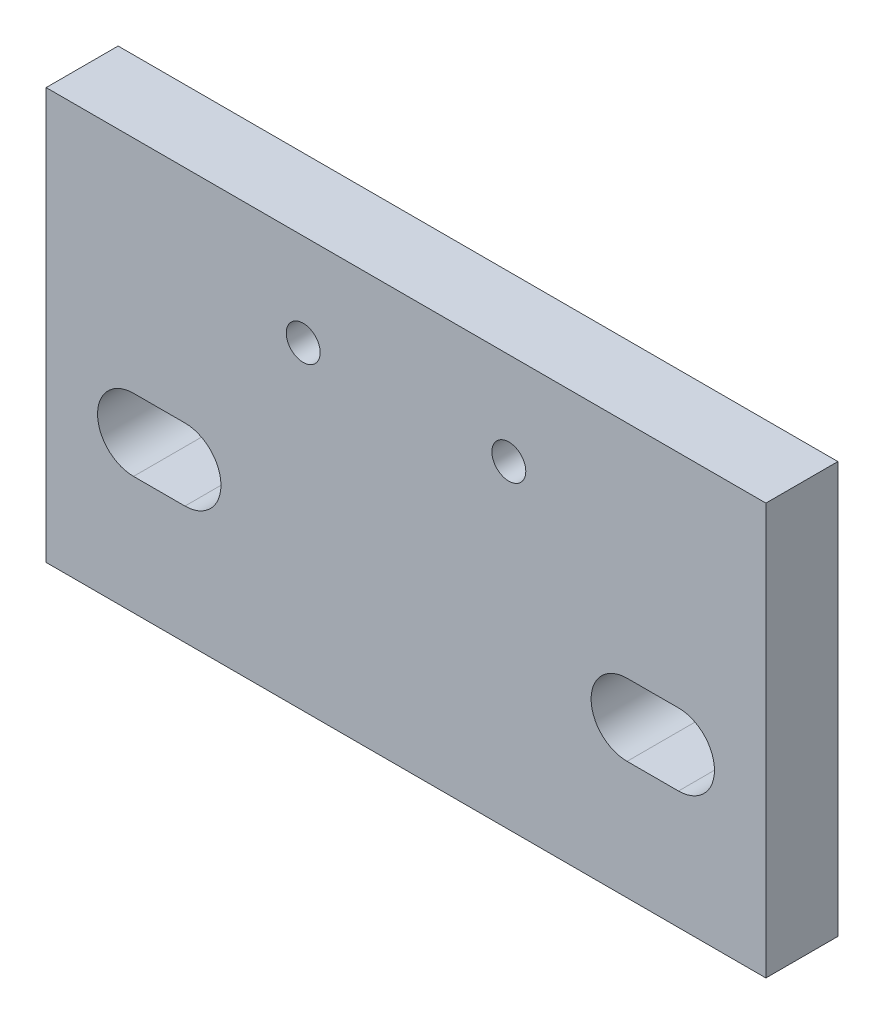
ISO-10303-21;
HEADER;
FILE_DESCRIPTION(('STEP AP214'),'2;1');
FILE_NAME('part.step','',(''),(''),'','','');
FILE_SCHEMA(('AUTOMOTIVE_DESIGN { 1 0 10303 214 1 1 1 1 }'));
ENDSEC;
DATA;
#1=APPLICATION_CONTEXT('core data for automotive mechanical design processes');
#2=APPLICATION_PROTOCOL_DEFINITION('international standard','automotive_design',2000,#1);
#3=PRODUCT_CONTEXT('',#1,'mechanical');
#4=PRODUCT('Part','Part','',(#3));
#5=PRODUCT_RELATED_PRODUCT_CATEGORY('part','',(#4));
#6=PRODUCT_DEFINITION_FORMATION('','',#4);
#7=PRODUCT_DEFINITION_CONTEXT('part definition',#1,'design');
#8=PRODUCT_DEFINITION('design','',#6,#7);
#9=PRODUCT_DEFINITION_SHAPE('','',#8);
#10=(LENGTH_UNIT() NAMED_UNIT(*) SI_UNIT(.MILLI.,.METRE.));
#11=(NAMED_UNIT(*) PLANE_ANGLE_UNIT() SI_UNIT($,.RADIAN.));
#12=(NAMED_UNIT(*) SI_UNIT($,.STERADIAN.) SOLID_ANGLE_UNIT());
#13=UNCERTAINTY_MEASURE_WITH_UNIT(LENGTH_MEASURE(1.E-05),#10,'distance_accuracy_value','');
#14=(GEOMETRIC_REPRESENTATION_CONTEXT(3) GLOBAL_UNCERTAINTY_ASSIGNED_CONTEXT((#13)) GLOBAL_UNIT_ASSIGNED_CONTEXT((#10,
#11,#12)) REPRESENTATION_CONTEXT('',''));
#15=CARTESIAN_POINT('',(0.,0.,0.));
#16=DIRECTION('',(0.,0.,1.));
#17=DIRECTION('',(1.,0.,0.));
#18=AXIS2_PLACEMENT_3D('',#15,#16,#17);
#19=CARTESIAN_POINT('',(-35.,0.,7.00000000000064));
#20=DIRECTION('',(1.,0.,0.));
#21=DIRECTION('',(0.,0.,-1.));
#22=AXIS2_PLACEMENT_3D('',#19,#20,#21);
#23=PLANE('',#22);
#24=DIRECTION('',(0.,-1.,0.));
#25=VECTOR('',#24,1.);
#26=CARTESIAN_POINT('',(-35.,0.,6.38378239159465E-13));
#27=LINE('',#26,#25);
#28=CARTESIAN_POINT('',(-35.,0.,6.38378239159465E-13));
#29=VERTEX_POINT('',#28);
#30=CARTESIAN_POINT('',(-35.,-40.,0.));
#31=VERTEX_POINT('',#30);
#32=EDGE_CURVE('E169',#29,#31,#27,.T.);
#33=ORIENTED_EDGE('',*,*,#32,.T.);
#34=DIRECTION('',(0.,0.,-1.));
#35=VECTOR('',#34,1.);
#36=CARTESIAN_POINT('',(-35.,-40.,7.00000000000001));
#37=LINE('',#36,#35);
#38=CARTESIAN_POINT('',(-35.,-40.,7.00000000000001));
#39=VERTEX_POINT('',#38);
#40=EDGE_CURVE('E11',#39,#31,#37,.T.);
#41=ORIENTED_EDGE('',*,*,#40,.F.);
#42=DIRECTION('',(0.,-1.,0.));
#43=VECTOR('',#42,1.);
#44=CARTESIAN_POINT('',(-35.,0.,7.00000000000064));
#45=LINE('',#44,#43);
#46=CARTESIAN_POINT('',(-35.,0.,7.00000000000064));
#47=VERTEX_POINT('',#46);
#48=EDGE_CURVE('E176',#47,#39,#45,.T.);
#49=ORIENTED_EDGE('',*,*,#48,.F.);
#50=DIRECTION('',(0.,0.,-1.));
#51=VECTOR('',#50,1.);
#52=CARTESIAN_POINT('',(-35.,0.,7.00000000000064));
#53=LINE('',#52,#51);
#54=EDGE_CURVE('E186',#47,#29,#53,.T.);
#55=ORIENTED_EDGE('',*,*,#54,.T.);
#56=EDGE_LOOP('',(#33,#41,#49,#55));
#57=FACE_BOUND('',#56,.T.);
#58=ADVANCED_FACE('F16',(#57),#23,.F.);
#59=CARTESIAN_POINT('',(-35.,-40.,7.00000000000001));
#60=DIRECTION('',(0.,1.,0.));
#61=DIRECTION('',(0.,0.,1.));
#62=AXIS2_PLACEMENT_3D('',#59,#60,#61);
#63=PLANE('',#62);
#64=DIRECTION('',(1.,0.,0.));
#65=VECTOR('',#64,1.);
#66=CARTESIAN_POINT('',(-35.,-40.,0.));
#67=LINE('',#66,#65);
#68=CARTESIAN_POINT('',(35.0000000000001,-40.0000000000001,0.));
#69=VERTEX_POINT('',#68);
#70=EDGE_CURVE('E189',#31,#69,#67,.T.);
#71=ORIENTED_EDGE('',*,*,#70,.T.);
#72=DIRECTION('',(0.,0.,-1.));
#73=VECTOR('',#72,1.);
#74=CARTESIAN_POINT('',(35.0000000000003,-40.0000000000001,7.00000000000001));
#75=LINE('',#74,#73);
#76=CARTESIAN_POINT('',(35.0000000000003,-40.0000000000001,7.00000000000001));
#77=VERTEX_POINT('',#76);
#78=EDGE_CURVE('E23',#77,#69,#75,.T.);
#79=ORIENTED_EDGE('',*,*,#78,.F.);
#80=DIRECTION('',(1.,0.,0.));
#81=VECTOR('',#80,1.);
#82=CARTESIAN_POINT('',(-35.,-40.,7.00000000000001));
#83=LINE('',#82,#81);
#84=EDGE_CURVE('E179',#39,#77,#83,.T.);
#85=ORIENTED_EDGE('',*,*,#84,.F.);
#86=ORIENTED_EDGE('',*,*,#40,.T.);
#87=EDGE_LOOP('',(#71,#79,#85,#86));
#88=FACE_BOUND('',#87,.T.);
#89=ADVANCED_FACE('F218',(#88),#63,.F.);
#90=CARTESIAN_POINT('',(35.0000000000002,1.11022302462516E-13,7.00000000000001));
#91=DIRECTION('',(-1.,0.,0.));
#92=DIRECTION('',(0.,0.,1.));
#93=AXIS2_PLACEMENT_3D('',#90,#91,#92);
#94=PLANE('',#93);
#95=DIRECTION('',(0.,1.,0.));
#96=VECTOR('',#95,1.);
#97=CARTESIAN_POINT('',(35.,0.,0.));
#98=LINE('',#97,#96);
#99=CARTESIAN_POINT('',(35.,0.,0.));
#100=VERTEX_POINT('',#99);
#101=EDGE_CURVE('E191',#69,#100,#98,.T.);
#102=ORIENTED_EDGE('',*,*,#101,.T.);
#103=DIRECTION('',(0.,0.,-1.));
#104=VECTOR('',#103,1.);
#105=CARTESIAN_POINT('',(35.0000000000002,1.11022302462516E-13,7.00000000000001));
#106=LINE('',#105,#104);
#107=CARTESIAN_POINT('',(35.0000000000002,1.11022302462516E-13,7.00000000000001));
#108=VERTEX_POINT('',#107);
#109=EDGE_CURVE('E196',#108,#100,#106,.T.);
#110=ORIENTED_EDGE('',*,*,#109,.F.);
#111=DIRECTION('',(0.,1.,0.));
#112=VECTOR('',#111,1.);
#113=CARTESIAN_POINT('',(35.0000000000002,1.11022302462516E-13,7.00000000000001));
#114=LINE('',#113,#112);
#115=EDGE_CURVE('E182',#77,#108,#114,.T.);
#116=ORIENTED_EDGE('',*,*,#115,.F.);
#117=ORIENTED_EDGE('',*,*,#78,.T.);
#118=EDGE_LOOP('',(#102,#110,#116,#117));
#119=FACE_BOUND('',#118,.T.);
#120=ADVANCED_FACE('F203',(#119),#94,.F.);
#121=CARTESIAN_POINT('',(-35.,0.,7.00000000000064));
#122=DIRECTION('',(0.,-1.,0.));
#123=DIRECTION('',(0.,0.,-1.));
#124=AXIS2_PLACEMENT_3D('',#121,#122,#123);
#125=PLANE('',#124);
#126=DIRECTION('',(-1.,0.,0.));
#127=VECTOR('',#126,1.);
#128=CARTESIAN_POINT('',(-35.,0.,6.38378239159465E-13));
#129=LINE('',#128,#127);
#130=EDGE_CURVE('E180',#100,#29,#129,.T.);
#131=ORIENTED_EDGE('',*,*,#130,.T.);
#132=ORIENTED_EDGE('',*,*,#54,.F.);
#133=DIRECTION('',(-1.,0.,0.));
#134=VECTOR('',#133,1.);
#135=CARTESIAN_POINT('',(-35.,0.,7.00000000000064));
#136=LINE('',#135,#134);
#137=EDGE_CURVE('E184',#108,#47,#136,.T.);
#138=ORIENTED_EDGE('',*,*,#137,.F.);
#139=ORIENTED_EDGE('',*,*,#109,.T.);
#140=EDGE_LOOP('',(#131,#132,#138,#139));
#141=FACE_BOUND('',#140,.T.);
#142=ADVANCED_FACE('F212',(#141),#125,.F.);
#143=CARTESIAN_POINT('',(-35.,-40.,7.00000000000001));
#144=DIRECTION('',(0.,0.,1.));
#145=DIRECTION('',(1.,0.,0.));
#146=AXIS2_PLACEMENT_3D('',#143,#144,#145);
#147=PLANE('',#146);
#148=CARTESIAN_POINT('',(10.,-9.00000000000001,7.00000000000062));
#149=DIRECTION('',(0.,0.,1.));
#150=DIRECTION('',(1.,0.,0.));
#151=AXIS2_PLACEMENT_3D('',#148,#149,#150);
#152=CIRCLE('',#151,1.65);
#153=CARTESIAN_POINT('',(11.65,-9.00000000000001,7.00000000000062));
#154=VERTEX_POINT('',#153);
#155=EDGE_CURVE('E277',#154,#154,#152,.T.);
#156=ORIENTED_EDGE('',*,*,#155,.F.);
#157=EDGE_LOOP('',(#156));
#158=FACE_BOUND('',#157,.T.);
#159=CARTESIAN_POINT('',(-9.99999999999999,-8.99999999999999,7.00000000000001));
#160=DIRECTION('',(0.,0.,1.));
#161=DIRECTION('',(1.,0.,0.));
#162=AXIS2_PLACEMENT_3D('',#159,#160,#161);
#163=CIRCLE('',#162,1.65);
#164=CARTESIAN_POINT('',(-8.34999999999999,-8.99999999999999,7.00000000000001));
#165=VERTEX_POINT('',#164);
#166=EDGE_CURVE('E128',#165,#165,#163,.T.);
#167=ORIENTED_EDGE('',*,*,#166,.F.);
#168=EDGE_LOOP('',(#167));
#169=FACE_BOUND('',#168,.T.);
#170=CARTESIAN_POINT('',(-21.5,-25.,7.00000000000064));
#171=DIRECTION('',(0.,0.,-1.));
#172=DIRECTION('',(-1.,0.,0.));
#173=AXIS2_PLACEMENT_3D('',#170,#171,#172);
#174=CIRCLE('',#173,3.5);
#175=CARTESIAN_POINT('',(-21.5,-21.5,7.00000000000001));
#176=VERTEX_POINT('',#175);
#177=CARTESIAN_POINT('',(-21.5,-28.5,7.00000000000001));
#178=VERTEX_POINT('',#177);
#179=EDGE_CURVE('E106',#176,#178,#174,.T.);
#180=ORIENTED_EDGE('',*,*,#179,.T.);
#181=DIRECTION('',(-1.,0.,0.));
#182=VECTOR('',#181,1.);
#183=CARTESIAN_POINT('',(-21.5,-28.5,7.00000000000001));
#184=LINE('',#183,#182);
#185=CARTESIAN_POINT('',(-26.5,-28.5,7.00000000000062));
#186=VERTEX_POINT('',#185);
#187=EDGE_CURVE('E115',#178,#186,#184,.T.);
#188=ORIENTED_EDGE('',*,*,#187,.T.);
#189=CARTESIAN_POINT('',(-26.5,-25.,7.00000000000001));
#190=DIRECTION('',(0.,0.,-1.));
#191=DIRECTION('',(1.,0.,0.));
#192=AXIS2_PLACEMENT_3D('',#189,#190,#191);
#193=CIRCLE('',#192,3.5);
#194=CARTESIAN_POINT('',(-26.5,-21.5,7.00000000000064));
#195=VERTEX_POINT('',#194);
#196=EDGE_CURVE('E30',#186,#195,#193,.T.);
#197=ORIENTED_EDGE('',*,*,#196,.T.);
#198=DIRECTION('',(1.,0.,0.));
#199=VECTOR('',#198,1.);
#200=CARTESIAN_POINT('',(-21.5,-21.5,7.00000000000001));
#201=LINE('',#200,#199);
#202=EDGE_CURVE('E112',#195,#176,#201,.T.);
#203=ORIENTED_EDGE('',*,*,#202,.T.);
#204=EDGE_LOOP('',(#180,#188,#197,#203));
#205=FACE_BOUND('',#204,.T.);
#206=CARTESIAN_POINT('',(26.5000000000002,-24.9999999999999,7.00000000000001));
#207=DIRECTION('',(0.,0.,-1.));
#208=DIRECTION('',(-1.,0.,0.));
#209=AXIS2_PLACEMENT_3D('',#206,#207,#208);
#210=CIRCLE('',#209,3.5);
#211=CARTESIAN_POINT('',(26.5,-21.5,7.00000000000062));
#212=VERTEX_POINT('',#211);
#213=CARTESIAN_POINT('',(26.5000000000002,-28.4999999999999,7.00000000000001));
#214=VERTEX_POINT('',#213);
#215=EDGE_CURVE('E144',#212,#214,#210,.T.);
#216=ORIENTED_EDGE('',*,*,#215,.T.);
#217=DIRECTION('',(-1.,0.,0.));
#218=VECTOR('',#217,1.);
#219=CARTESIAN_POINT('',(26.5000000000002,-28.4999999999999,7.00000000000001));
#220=LINE('',#219,#218);
#221=CARTESIAN_POINT('',(21.5000000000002,-28.4999999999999,7.00000000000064));
#222=VERTEX_POINT('',#221);
#223=EDGE_CURVE('E147',#214,#222,#220,.T.);
#224=ORIENTED_EDGE('',*,*,#223,.T.);
#225=CARTESIAN_POINT('',(21.5,-25.,7.00000000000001));
#226=DIRECTION('',(0.,0.,-1.));
#227=DIRECTION('',(1.,0.,0.));
#228=AXIS2_PLACEMENT_3D('',#225,#226,#227);
#229=CIRCLE('',#228,3.5);
#230=CARTESIAN_POINT('',(21.5,-21.5,7.00000000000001));
#231=VERTEX_POINT('',#230);
#232=EDGE_CURVE('E151',#222,#231,#229,.T.);
#233=ORIENTED_EDGE('',*,*,#232,.T.);
#234=DIRECTION('',(1.,0.,0.));
#235=VECTOR('',#234,1.);
#236=CARTESIAN_POINT('',(26.5,-21.5,7.00000000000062));
#237=LINE('',#236,#235);
#238=EDGE_CURVE('E154',#231,#212,#237,.T.);
#239=ORIENTED_EDGE('',*,*,#238,.T.);
#240=EDGE_LOOP('',(#216,#224,#233,#239));
#241=FACE_BOUND('',#240,.T.);
#242=ORIENTED_EDGE('',*,*,#48,.T.);
#243=ORIENTED_EDGE('',*,*,#84,.T.);
#244=ORIENTED_EDGE('',*,*,#115,.T.);
#245=ORIENTED_EDGE('',*,*,#137,.T.);
#246=EDGE_LOOP('',(#242,#243,#244,#245));
#247=FACE_BOUND('',#246,.T.);
#248=ADVANCED_FACE('F119',(#158,#169,#205,#241,#247),#147,.T.);
#249=CARTESIAN_POINT('',(-35.,-40.,0.));
#250=DIRECTION('',(0.,0.,1.));
#251=DIRECTION('',(1.,0.,0.));
#252=AXIS2_PLACEMENT_3D('',#249,#250,#251);
#253=PLANE('',#252);
#254=CARTESIAN_POINT('',(10.,-9.00000000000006,6.38378239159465E-13));
#255=DIRECTION('',(0.,0.,1.));
#256=DIRECTION('',(1.,0.,0.));
#257=AXIS2_PLACEMENT_3D('',#254,#255,#256);
#258=CIRCLE('',#257,1.65);
#259=CARTESIAN_POINT('',(11.6500000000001,-9.00000000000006,6.38378239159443E-13));
#260=VERTEX_POINT('',#259);
#261=EDGE_CURVE('E274',#260,#260,#258,.T.);
#262=ORIENTED_EDGE('',*,*,#261,.T.);
#263=EDGE_LOOP('',(#262));
#264=FACE_BOUND('',#263,.T.);
#265=CARTESIAN_POINT('',(-10.,-8.99999999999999,0.));
#266=DIRECTION('',(0.,0.,1.));
#267=DIRECTION('',(1.,0.,0.));
#268=AXIS2_PLACEMENT_3D('',#265,#266,#267);
#269=CIRCLE('',#268,1.65);
#270=CARTESIAN_POINT('',(-8.35,-8.99999999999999,0.));
#271=VERTEX_POINT('',#270);
#272=EDGE_CURVE('E278',#271,#271,#269,.T.);
#273=ORIENTED_EDGE('',*,*,#272,.T.);
#274=EDGE_LOOP('',(#273));
#275=FACE_BOUND('',#274,.T.);
#276=DIRECTION('',(-1.,0.,0.));
#277=VECTOR('',#276,1.);
#278=CARTESIAN_POINT('',(-21.5,-28.5,0.));
#279=LINE('',#278,#277);
#280=CARTESIAN_POINT('',(-21.5,-28.5,0.));
#281=VERTEX_POINT('',#280);
#282=CARTESIAN_POINT('',(-26.5,-28.5,6.38378239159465E-13));
#283=VERTEX_POINT('',#282);
#284=EDGE_CURVE('E134',#281,#283,#279,.T.);
#285=ORIENTED_EDGE('',*,*,#284,.F.);
#286=CARTESIAN_POINT('',(-21.5,-25.,6.38378239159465E-13));
#287=DIRECTION('',(0.,0.,-1.));
#288=DIRECTION('',(-1.,0.,0.));
#289=AXIS2_PLACEMENT_3D('',#286,#287,#288);
#290=CIRCLE('',#289,3.5);
#291=CARTESIAN_POINT('',(-21.5,-21.5000000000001,0.));
#292=VERTEX_POINT('',#291);
#293=EDGE_CURVE('E38',#292,#281,#290,.T.);
#294=ORIENTED_EDGE('',*,*,#293,.F.);
#295=DIRECTION('',(1.,0.,0.));
#296=VECTOR('',#295,1.);
#297=CARTESIAN_POINT('',(-21.5,-21.5000000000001,0.));
#298=LINE('',#297,#296);
#299=CARTESIAN_POINT('',(-26.5,-21.5,6.38378239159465E-13));
#300=VERTEX_POINT('',#299);
#301=EDGE_CURVE('E122',#300,#292,#298,.T.);
#302=ORIENTED_EDGE('',*,*,#301,.F.);
#303=CARTESIAN_POINT('',(-26.5,-25.,0.));
#304=DIRECTION('',(0.,0.,-1.));
#305=DIRECTION('',(1.,0.,0.));
#306=AXIS2_PLACEMENT_3D('',#303,#304,#305);
#307=CIRCLE('',#306,3.5);
#308=EDGE_CURVE('E125',#283,#300,#307,.T.);
#309=ORIENTED_EDGE('',*,*,#308,.F.);
#310=EDGE_LOOP('',(#285,#294,#302,#309));
#311=FACE_BOUND('',#310,.T.);
#312=DIRECTION('',(-1.,0.,0.));
#313=VECTOR('',#312,1.);
#314=CARTESIAN_POINT('',(26.5000000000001,-28.5000000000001,0.));
#315=LINE('',#314,#313);
#316=CARTESIAN_POINT('',(26.5000000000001,-28.5000000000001,0.));
#317=VERTEX_POINT('',#316);
#318=CARTESIAN_POINT('',(21.5000000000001,-28.5000000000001,6.38378239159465E-13));
#319=VERTEX_POINT('',#318);
#320=EDGE_CURVE('E159',#317,#319,#315,.T.);
#321=ORIENTED_EDGE('',*,*,#320,.F.);
#322=CARTESIAN_POINT('',(26.5,-25.,0.));
#323=DIRECTION('',(0.,0.,-1.));
#324=DIRECTION('',(-1.,0.,0.));
#325=AXIS2_PLACEMENT_3D('',#322,#323,#324);
#326=CIRCLE('',#325,3.5);
#327=CARTESIAN_POINT('',(26.5,-21.5,6.38378239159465E-13));
#328=VERTEX_POINT('',#327);
#329=EDGE_CURVE('E140',#328,#317,#326,.T.);
#330=ORIENTED_EDGE('',*,*,#329,.F.);
#331=DIRECTION('',(1.,0.,0.));
#332=VECTOR('',#331,1.);
#333=CARTESIAN_POINT('',(26.5,-21.5,6.38378239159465E-13));
#334=LINE('',#333,#332);
#335=CARTESIAN_POINT('',(21.5,-21.5,0.));
#336=VERTEX_POINT('',#335);
#337=EDGE_CURVE('E148',#336,#328,#334,.T.);
#338=ORIENTED_EDGE('',*,*,#337,.F.);
#339=CARTESIAN_POINT('',(21.5,-25.,0.));
#340=DIRECTION('',(0.,0.,-1.));
#341=DIRECTION('',(1.,0.,0.));
#342=AXIS2_PLACEMENT_3D('',#339,#340,#341);
#343=CIRCLE('',#342,3.5);
#344=EDGE_CURVE('E162',#319,#336,#343,.T.);
#345=ORIENTED_EDGE('',*,*,#344,.F.);
#346=EDGE_LOOP('',(#321,#330,#338,#345));
#347=FACE_BOUND('',#346,.T.);
#348=ORIENTED_EDGE('',*,*,#32,.F.);
#349=ORIENTED_EDGE('',*,*,#130,.F.);
#350=ORIENTED_EDGE('',*,*,#101,.F.);
#351=ORIENTED_EDGE('',*,*,#70,.F.);
#352=EDGE_LOOP('',(#348,#349,#350,#351));
#353=FACE_BOUND('',#352,.T.);
#354=ADVANCED_FACE('F209',(#264,#275,#311,#347,#353),#253,.F.);
#355=CARTESIAN_POINT('',(26.5000000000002,-24.9999999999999,7.00000000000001));
#356=DIRECTION('',(0.,0.,-1.));
#357=DIRECTION('',(-1.,0.,0.));
#358=AXIS2_PLACEMENT_3D('',#355,#356,#357);
#359=CYLINDRICAL_SURFACE('',#358,3.5);
#360=ORIENTED_EDGE('',*,*,#329,.T.);
#361=DIRECTION('',(0.,0.,-1.));
#362=VECTOR('',#361,1.);
#363=CARTESIAN_POINT('',(26.5000000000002,-28.4999999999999,7.00000000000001));
#364=LINE('',#363,#362);
#365=EDGE_CURVE('E157',#214,#317,#364,.T.);
#366=ORIENTED_EDGE('',*,*,#365,.F.);
#367=ORIENTED_EDGE('',*,*,#215,.F.);
#368=DIRECTION('',(0.,0.,-1.));
#369=VECTOR('',#368,1.);
#370=CARTESIAN_POINT('',(26.5,-21.5,7.00000000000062));
#371=LINE('',#370,#369);
#372=EDGE_CURVE('E167',#212,#328,#371,.T.);
#373=ORIENTED_EDGE('',*,*,#372,.T.);
#374=EDGE_LOOP('',(#360,#366,#367,#373));
#375=FACE_BOUND('',#374,.T.);
#376=ADVANCED_FACE('F231',(#375),#359,.F.);
#377=CARTESIAN_POINT('',(26.5,-21.5,7.00000000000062));
#378=DIRECTION('',(0.,1.,0.));
#379=DIRECTION('',(-1.,0.,0.));
#380=AXIS2_PLACEMENT_3D('',#377,#378,#379);
#381=PLANE('',#380);
#382=ORIENTED_EDGE('',*,*,#337,.T.);
#383=ORIENTED_EDGE('',*,*,#372,.F.);
#384=ORIENTED_EDGE('',*,*,#238,.F.);
#385=DIRECTION('',(0.,0.,-1.));
#386=VECTOR('',#385,1.);
#387=CARTESIAN_POINT('',(21.5,-21.5,7.00000000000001));
#388=LINE('',#387,#386);
#389=EDGE_CURVE('E170',#231,#336,#388,.T.);
#390=ORIENTED_EDGE('',*,*,#389,.T.);
#391=EDGE_LOOP('',(#382,#383,#384,#390));
#392=FACE_BOUND('',#391,.T.);
#393=ADVANCED_FACE('F238',(#392),#381,.F.);
#394=CARTESIAN_POINT('',(21.5,-25.,7.00000000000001));
#395=DIRECTION('',(0.,0.,-1.));
#396=DIRECTION('',(-1.,0.,0.));
#397=AXIS2_PLACEMENT_3D('',#394,#395,#396);
#398=CYLINDRICAL_SURFACE('',#397,3.5);
#399=ORIENTED_EDGE('',*,*,#344,.T.);
#400=ORIENTED_EDGE('',*,*,#389,.F.);
#401=ORIENTED_EDGE('',*,*,#232,.F.);
#402=DIRECTION('',(0.,0.,-1.));
#403=VECTOR('',#402,1.);
#404=CARTESIAN_POINT('',(21.5000000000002,-28.4999999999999,7.00000000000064));
#405=LINE('',#404,#403);
#406=EDGE_CURVE('E172',#222,#319,#405,.T.);
#407=ORIENTED_EDGE('',*,*,#406,.T.);
#408=EDGE_LOOP('',(#399,#400,#401,#407));
#409=FACE_BOUND('',#408,.T.);
#410=ADVANCED_FACE('F243',(#409),#398,.F.);
#411=CARTESIAN_POINT('',(26.5000000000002,-28.4999999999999,7.00000000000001));
#412=DIRECTION('',(0.,-1.,0.));
#413=DIRECTION('',(1.,0.,0.));
#414=AXIS2_PLACEMENT_3D('',#411,#412,#413);
#415=PLANE('',#414);
#416=ORIENTED_EDGE('',*,*,#320,.T.);
#417=ORIENTED_EDGE('',*,*,#406,.F.);
#418=ORIENTED_EDGE('',*,*,#223,.F.);
#419=ORIENTED_EDGE('',*,*,#365,.T.);
#420=EDGE_LOOP('',(#416,#417,#418,#419));
#421=FACE_BOUND('',#420,.T.);
#422=ADVANCED_FACE('F240',(#421),#415,.F.);
#423=CARTESIAN_POINT('',(-21.5,-25.,7.00000000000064));
#424=DIRECTION('',(0.,0.,-1.));
#425=DIRECTION('',(-1.,0.,0.));
#426=AXIS2_PLACEMENT_3D('',#423,#424,#425);
#427=CYLINDRICAL_SURFACE('',#426,3.5);
#428=ORIENTED_EDGE('',*,*,#293,.T.);
#429=DIRECTION('',(0.,0.,-1.));
#430=VECTOR('',#429,1.);
#431=CARTESIAN_POINT('',(-21.5,-28.5,7.00000000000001));
#432=LINE('',#431,#430);
#433=EDGE_CURVE('E102',#178,#281,#432,.T.);
#434=ORIENTED_EDGE('',*,*,#433,.F.);
#435=ORIENTED_EDGE('',*,*,#179,.F.);
#436=DIRECTION('',(0.,0.,-1.));
#437=VECTOR('',#436,1.);
#438=CARTESIAN_POINT('',(-21.5,-21.5,7.00000000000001));
#439=LINE('',#438,#437);
#440=EDGE_CURVE('E138',#176,#292,#439,.T.);
#441=ORIENTED_EDGE('',*,*,#440,.T.);
#442=EDGE_LOOP('',(#428,#434,#435,#441));
#443=FACE_BOUND('',#442,.T.);
#444=ADVANCED_FACE('F104',(#443),#427,.F.);
#445=CARTESIAN_POINT('',(-21.5,-21.5,7.00000000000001));
#446=DIRECTION('',(0.,1.,0.));
#447=DIRECTION('',(0.,0.,1.));
#448=AXIS2_PLACEMENT_3D('',#445,#446,#447);
#449=PLANE('',#448);
#450=ORIENTED_EDGE('',*,*,#301,.T.);
#451=ORIENTED_EDGE('',*,*,#440,.F.);
#452=ORIENTED_EDGE('',*,*,#202,.F.);
#453=DIRECTION('',(0.,0.,-1.));
#454=VECTOR('',#453,1.);
#455=CARTESIAN_POINT('',(-26.5,-21.5,7.00000000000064));
#456=LINE('',#455,#454);
#457=EDGE_CURVE('E141',#195,#300,#456,.T.);
#458=ORIENTED_EDGE('',*,*,#457,.T.);
#459=EDGE_LOOP('',(#450,#451,#452,#458));
#460=FACE_BOUND('',#459,.T.);
#461=ADVANCED_FACE('F253',(#460),#449,.F.);
#462=CARTESIAN_POINT('',(-26.5,-25.,7.00000000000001));
#463=DIRECTION('',(0.,0.,-1.));
#464=DIRECTION('',(-1.,0.,0.));
#465=AXIS2_PLACEMENT_3D('',#462,#463,#464);
#466=CYLINDRICAL_SURFACE('',#465,3.5);
#467=ORIENTED_EDGE('',*,*,#308,.T.);
#468=ORIENTED_EDGE('',*,*,#457,.F.);
#469=ORIENTED_EDGE('',*,*,#196,.F.);
#470=DIRECTION('',(0.,0.,-1.));
#471=VECTOR('',#470,1.);
#472=CARTESIAN_POINT('',(-26.5,-28.5,7.00000000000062));
#473=LINE('',#472,#471);
#474=EDGE_CURVE('E111',#186,#283,#473,.T.);
#475=ORIENTED_EDGE('',*,*,#474,.T.);
#476=EDGE_LOOP('',(#467,#468,#469,#475));
#477=FACE_BOUND('',#476,.T.);
#478=ADVANCED_FACE('F257',(#477),#466,.F.);
#479=CARTESIAN_POINT('',(-21.5,-28.5,7.00000000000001));
#480=DIRECTION('',(0.,-1.,0.));
#481=DIRECTION('',(0.,0.,-1.));
#482=AXIS2_PLACEMENT_3D('',#479,#480,#481);
#483=PLANE('',#482);
#484=ORIENTED_EDGE('',*,*,#284,.T.);
#485=ORIENTED_EDGE('',*,*,#474,.F.);
#486=ORIENTED_EDGE('',*,*,#187,.F.);
#487=ORIENTED_EDGE('',*,*,#433,.T.);
#488=EDGE_LOOP('',(#484,#485,#486,#487));
#489=FACE_BOUND('',#488,.T.);
#490=ADVANCED_FACE('F116',(#489),#483,.F.);
#491=CARTESIAN_POINT('',(-9.99999999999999,-8.99999999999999,7.00000000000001));
#492=DIRECTION('',(0.,0.,1.));
#493=DIRECTION('',(1.,0.,0.));
#494=AXIS2_PLACEMENT_3D('',#491,#492,#493);
#495=CYLINDRICAL_SURFACE('',#494,1.65);
#496=ORIENTED_EDGE('',*,*,#272,.F.);
#497=EDGE_LOOP('',(#496));
#498=FACE_BOUND('',#497,.T.);
#499=ORIENTED_EDGE('',*,*,#166,.T.);
#500=EDGE_LOOP('',(#499));
#501=FACE_BOUND('',#500,.T.);
#502=ADVANCED_FACE('F256',(#498,#501),#495,.F.);
#503=CARTESIAN_POINT('',(10.,-9.00000000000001,7.00000000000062));
#504=DIRECTION('',(0.,0.,1.));
#505=DIRECTION('',(1.,0.,0.));
#506=AXIS2_PLACEMENT_3D('',#503,#504,#505);
#507=CYLINDRICAL_SURFACE('',#506,1.65);
#508=ORIENTED_EDGE('',*,*,#261,.F.);
#509=EDGE_LOOP('',(#508));
#510=FACE_BOUND('',#509,.T.);
#511=ORIENTED_EDGE('',*,*,#155,.T.);
#512=EDGE_LOOP('',(#511));
#513=FACE_BOUND('',#512,.T.);
#514=ADVANCED_FACE('F265',(#510,#513),#507,.F.);
#515=CLOSED_SHELL('',(#58,#89,#120,#142,#248,#354,#376,#393,#410,#422,#444,#461,#478,#490,#502,#514));
#516=MANIFOLD_SOLID_BREP('B1',#515);
#517=ADVANCED_BREP_SHAPE_REPRESENTATION('',(#18,#516),#14);
#518=SHAPE_DEFINITION_REPRESENTATION(#9,#517);
ENDSEC;
END-ISO-10303-21;
